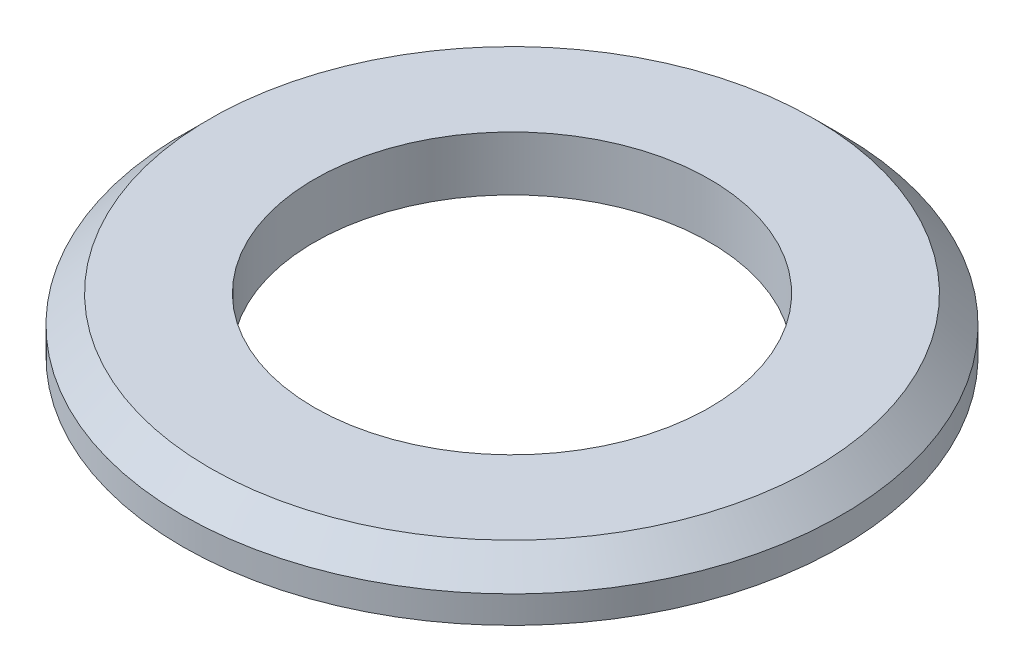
ISO-10303-21;
HEADER;
FILE_DESCRIPTION(('STEP AP214'),'2;1');
FILE_NAME('part.step','',(''),(''),'','','');
FILE_SCHEMA(('AUTOMOTIVE_DESIGN { 1 0 10303 214 1 1 1 1 }'));
ENDSEC;
DATA;
#1=APPLICATION_CONTEXT('core data for automotive mechanical design processes');
#2=APPLICATION_PROTOCOL_DEFINITION('international standard','automotive_design',2000,#1);
#3=PRODUCT_CONTEXT('',#1,'mechanical');
#4=PRODUCT('Part','Part','',(#3));
#5=PRODUCT_RELATED_PRODUCT_CATEGORY('part','',(#4));
#6=PRODUCT_DEFINITION_FORMATION('','',#4);
#7=PRODUCT_DEFINITION_CONTEXT('part definition',#1,'design');
#8=PRODUCT_DEFINITION('design','',#6,#7);
#9=PRODUCT_DEFINITION_SHAPE('','',#8);
#10=(LENGTH_UNIT() NAMED_UNIT(*) SI_UNIT(.MILLI.,.METRE.));
#11=(NAMED_UNIT(*) PLANE_ANGLE_UNIT() SI_UNIT($,.RADIAN.));
#12=(NAMED_UNIT(*) SI_UNIT($,.STERADIAN.) SOLID_ANGLE_UNIT());
#13=UNCERTAINTY_MEASURE_WITH_UNIT(LENGTH_MEASURE(1.E-05),#10,'distance_accuracy_value','');
#14=(GEOMETRIC_REPRESENTATION_CONTEXT(3) GLOBAL_UNCERTAINTY_ASSIGNED_CONTEXT((#13)) GLOBAL_UNIT_ASSIGNED_CONTEXT((#10,
#11,#12)) REPRESENTATION_CONTEXT('',''));
#15=CARTESIAN_POINT('',(0.,0.,0.));
#16=DIRECTION('',(0.,0.,1.));
#17=DIRECTION('',(1.,0.,0.));
#18=AXIS2_PLACEMENT_3D('',#15,#16,#17);
#19=CARTESIAN_POINT('',(0.,12.,0.));
#20=DIRECTION('',(0.,1.,0.));
#21=DIRECTION('',(0.,0.,1.));
#22=AXIS2_PLACEMENT_3D('',#19,#20,#21);
#23=PLANE('',#22);
#24=CARTESIAN_POINT('',(0.,12.,0.));
#25=DIRECTION('',(0.,1.,0.));
#26=DIRECTION('',(0.,0.,1.));
#27=AXIS2_PLACEMENT_3D('',#24,#25,#26);
#28=CIRCLE('',#27,66.5);
#29=CARTESIAN_POINT('',(0.,12.,-66.5));
#30=VERTEX_POINT('',#29);
#31=EDGE_CURVE('E35',#30,#30,#28,.T.);
#32=ORIENTED_EDGE('',*,*,#31,.T.);
#33=EDGE_LOOP('',(#32));
#34=FACE_BOUND('',#33,.T.);
#35=CARTESIAN_POINT('',(0.,12.,0.));
#36=DIRECTION('',(0.,1.,0.));
#37=DIRECTION('',(0.,0.,1.));
#38=AXIS2_PLACEMENT_3D('',#35,#36,#37);
#39=CIRCLE('',#38,43.5);
#40=CARTESIAN_POINT('',(0.,12.,43.5));
#41=VERTEX_POINT('',#40);
#42=EDGE_CURVE('E43',#41,#41,#39,.T.);
#43=ORIENTED_EDGE('',*,*,#42,.F.);
#44=EDGE_LOOP('',(#43));
#45=FACE_BOUND('',#44,.T.);
#46=ADVANCED_FACE('F28',(#34,#45),#23,.T.);
#47=CARTESIAN_POINT('',(0.,0.,0.));
#48=DIRECTION('',(0.,1.,0.));
#49=DIRECTION('',(0.,0.,1.));
#50=AXIS2_PLACEMENT_3D('',#47,#48,#49);
#51=PLANE('',#50);
#52=CARTESIAN_POINT('',(0.,0.,0.));
#53=DIRECTION('',(0.,1.,0.));
#54=DIRECTION('',(0.,0.,1.));
#55=AXIS2_PLACEMENT_3D('',#52,#53,#54);
#56=CIRCLE('',#55,72.5);
#57=CARTESIAN_POINT('',(0.,0.,72.5));
#58=VERTEX_POINT('',#57);
#59=EDGE_CURVE('E39',#58,#58,#56,.T.);
#60=ORIENTED_EDGE('',*,*,#59,.F.);
#61=EDGE_LOOP('',(#60));
#62=FACE_BOUND('',#61,.T.);
#63=CARTESIAN_POINT('',(0.,0.,0.));
#64=DIRECTION('',(0.,1.,0.));
#65=DIRECTION('',(0.,0.,1.));
#66=AXIS2_PLACEMENT_3D('',#63,#64,#65);
#67=CIRCLE('',#66,43.5);
#68=CARTESIAN_POINT('',(0.,0.,43.5));
#69=VERTEX_POINT('',#68);
#70=EDGE_CURVE('E48',#69,#69,#67,.T.);
#71=ORIENTED_EDGE('',*,*,#70,.T.);
#72=EDGE_LOOP('',(#71));
#73=FACE_BOUND('',#72,.T.);
#74=ADVANCED_FACE('F52',(#62,#73),#51,.F.);
#75=CARTESIAN_POINT('',(0.,12.,0.));
#76=DIRECTION('',(0.,-1.,0.));
#77=DIRECTION('',(0.,0.,-1.));
#78=AXIS2_PLACEMENT_3D('',#75,#76,#77);
#79=CYLINDRICAL_SURFACE('',#78,72.5);
#80=CARTESIAN_POINT('',(0.,5.99999999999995,0.));
#81=DIRECTION('',(0.,1.,0.));
#82=DIRECTION('',(0.,0.,1.));
#83=AXIS2_PLACEMENT_3D('',#80,#81,#82);
#84=CIRCLE('',#83,72.5);
#85=CARTESIAN_POINT('',(0.,5.99999999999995,-72.5));
#86=VERTEX_POINT('',#85);
#87=EDGE_CURVE('E10',#86,#86,#84,.F.);
#88=ORIENTED_EDGE('',*,*,#87,.T.);
#89=EDGE_LOOP('',(#88));
#90=FACE_BOUND('',#89,.T.);
#91=ORIENTED_EDGE('',*,*,#59,.T.);
#92=EDGE_LOOP('',(#91));
#93=FACE_BOUND('',#92,.T.);
#94=ADVANCED_FACE('F30',(#90,#93),#79,.T.);
#95=CARTESIAN_POINT('',(0.,12.,0.));
#96=DIRECTION('',(0.,-1.,0.));
#97=DIRECTION('',(0.,0.,-1.));
#98=AXIS2_PLACEMENT_3D('',#95,#96,#97);
#99=CYLINDRICAL_SURFACE('',#98,43.5);
#100=ORIENTED_EDGE('',*,*,#42,.T.);
#101=EDGE_LOOP('',(#100));
#102=FACE_BOUND('',#101,.T.);
#103=ORIENTED_EDGE('',*,*,#70,.F.);
#104=EDGE_LOOP('',(#103));
#105=FACE_BOUND('',#104,.T.);
#106=ADVANCED_FACE('F54',(#102,#105),#99,.F.);
#107=CARTESIAN_POINT('',(0.,12.,0.));
#108=DIRECTION('',(0.,-1.,0.));
#109=DIRECTION('',(0.,0.,-1.));
#110=AXIS2_PLACEMENT_3D('',#107,#108,#109);
#111=CONICAL_SURFACE('',#110,66.5,0.785398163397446);
#112=CARTESIAN_POINT('',(0.,5.99999999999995,-72.5));
#113=CARTESIAN_POINT('',(0.,6.06249999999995,-72.4375));
#114=CARTESIAN_POINT('',(0.,6.12499999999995,-72.375));
#115=CARTESIAN_POINT('',(0.,6.24999999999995,-72.25));
#116=CARTESIAN_POINT('',(0.,6.31249999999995,-72.1875));
#117=CARTESIAN_POINT('',(0.,6.43749999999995,-72.0625));
#118=CARTESIAN_POINT('',(0.,6.49999999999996,-72.));
#119=CARTESIAN_POINT('',(0.,6.62499999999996,-71.875));
#120=CARTESIAN_POINT('',(0.,6.68749999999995,-71.8125));
#121=CARTESIAN_POINT('',(0.,6.81249999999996,-71.6875));
#122=CARTESIAN_POINT('',(0.,6.87499999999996,-71.625));
#123=CARTESIAN_POINT('',(0.,6.99999999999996,-71.5));
#124=CARTESIAN_POINT('',(0.,7.06249999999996,-71.4375));
#125=CARTESIAN_POINT('',(0.,7.18749999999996,-71.3125));
#126=CARTESIAN_POINT('',(0.,7.24999999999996,-71.25));
#127=CARTESIAN_POINT('',(0.,7.37499999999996,-71.125));
#128=CARTESIAN_POINT('',(0.,7.43749999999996,-71.0625));
#129=CARTESIAN_POINT('',(0.,7.56249999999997,-70.9375));
#130=CARTESIAN_POINT('',(0.,7.62499999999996,-70.875));
#131=CARTESIAN_POINT('',(0.,7.74999999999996,-70.75));
#132=CARTESIAN_POINT('',(0.,7.81249999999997,-70.6875));
#133=CARTESIAN_POINT('',(0.,7.93749999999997,-70.5625));
#134=CARTESIAN_POINT('',(0.,7.99999999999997,-70.5));
#135=CARTESIAN_POINT('',(0.,8.12499999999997,-70.375));
#136=CARTESIAN_POINT('',(0.,8.18749999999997,-70.3125));
#137=CARTESIAN_POINT('',(0.,8.31249999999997,-70.1875));
#138=CARTESIAN_POINT('',(0.,8.37499999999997,-70.125));
#139=CARTESIAN_POINT('',(0.,8.49999999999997,-70.));
#140=CARTESIAN_POINT('',(0.,8.56249999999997,-69.9375));
#141=CARTESIAN_POINT('',(0.,8.68749999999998,-69.8125));
#142=CARTESIAN_POINT('',(0.,8.74999999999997,-69.75));
#143=CARTESIAN_POINT('',(0.,8.87499999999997,-69.625));
#144=CARTESIAN_POINT('',(0.,8.93749999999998,-69.5625));
#145=CARTESIAN_POINT('',(0.,9.06249999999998,-69.4375));
#146=CARTESIAN_POINT('',(0.,9.12499999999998,-69.375));
#147=CARTESIAN_POINT('',(0.,9.24999999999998,-69.25));
#148=CARTESIAN_POINT('',(0.,9.31249999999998,-69.1875));
#149=CARTESIAN_POINT('',(0.,9.43749999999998,-69.0625));
#150=CARTESIAN_POINT('',(0.,9.49999999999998,-69.));
#151=CARTESIAN_POINT('',(0.,9.62499999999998,-68.875));
#152=CARTESIAN_POINT('',(0.,9.68749999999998,-68.8125));
#153=CARTESIAN_POINT('',(0.,9.81249999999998,-68.6875));
#154=CARTESIAN_POINT('',(0.,9.87499999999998,-68.625));
#155=CARTESIAN_POINT('',(0.,9.99999999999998,-68.5));
#156=CARTESIAN_POINT('',(0.,10.0625,-68.4375));
#157=CARTESIAN_POINT('',(0.,10.1875,-68.3125));
#158=CARTESIAN_POINT('',(0.,10.25,-68.25));
#159=CARTESIAN_POINT('',(0.,10.375,-68.125));
#160=CARTESIAN_POINT('',(0.,10.4375,-68.0625));
#161=CARTESIAN_POINT('',(0.,10.5625,-67.9375));
#162=CARTESIAN_POINT('',(0.,10.625,-67.875));
#163=CARTESIAN_POINT('',(0.,10.75,-67.75));
#164=CARTESIAN_POINT('',(0.,10.8125,-67.6875));
#165=CARTESIAN_POINT('',(0.,10.9375,-67.5625));
#166=CARTESIAN_POINT('',(0.,11.,-67.5));
#167=CARTESIAN_POINT('',(0.,11.125,-67.375));
#168=CARTESIAN_POINT('',(0.,11.1875,-67.3125));
#169=CARTESIAN_POINT('',(0.,11.3125,-67.1875));
#170=CARTESIAN_POINT('',(0.,11.375,-67.125));
#171=CARTESIAN_POINT('',(0.,11.5,-67.));
#172=CARTESIAN_POINT('',(0.,11.5625,-66.9375));
#173=CARTESIAN_POINT('',(0.,11.6875,-66.8125));
#174=CARTESIAN_POINT('',(0.,11.75,-66.75));
#175=CARTESIAN_POINT('',(0.,11.875,-66.625));
#176=CARTESIAN_POINT('',(0.,11.9375,-66.5625));
#177=CARTESIAN_POINT('',(0.,12.,-66.5));
#178=B_SPLINE_CURVE_WITH_KNOTS('',3,(#112,#113,#114,#115,#116,#117,#118,#119,#120,#121,#122,
#123,#124,#125,#126,#127,#128,#129,#130,#131,#132,#133,#134,#135,#136,#137,#138,#139,#140,#141,
#142,#143,#144,#145,#146,#147,#148,#149,#150,#151,#152,#153,#154,#155,#156,#157,#158,#159,#160,
#161,#162,#163,#164,#165,#166,#167,#168,#169,#170,#171,#172,#173,#174,#175,#176,#177),
.UNSPECIFIED.,.F.,.F.,(4,2,2,2,2,2,2,2,2,2,2,2,2,2,2,2,2,2,2,2,2,2,2,2,2,2,2,2,2,2,2,2,4),(0.,
0.265165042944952,0.530330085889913,0.795495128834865,1.06066017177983,1.32582521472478,
1.59099025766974,1.8561553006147,2.12132034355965,2.38648538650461,2.65165042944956,
2.91681547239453,3.18198051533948,3.44714555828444,3.71231060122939,3.97747564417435,
4.2426406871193,4.50780573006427,4.77297077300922,5.03813581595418,5.30330085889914,
5.56846590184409,5.83363094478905,6.098795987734,6.36396103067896,6.62912607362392,
6.89429111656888,7.15945615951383,7.42462120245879,7.68978624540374,7.9549512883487,
8.22011633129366,8.48528137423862),.UNSPECIFIED.);
#179=EDGE_CURVE('BSEAM56',#86,#30,#178,.T.);
#180=ORIENTED_EDGE('',*,*,#87,.F.);
#181=ORIENTED_EDGE('',*,*,#31,.F.);
#182=ORIENTED_EDGE('',*,*,#179,.T.);
#183=ORIENTED_EDGE('',*,*,#179,.F.);
#184=EDGE_LOOP('',(#180,#182,#181,#183));
#185=FACE_BOUND('',#184,.T.);
#186=ADVANCED_FACE('F56',(#185),#111,.T.);
#187=CLOSED_SHELL('',(#46,#74,#94,#106,#186));
#188=MANIFOLD_SOLID_BREP('B2',#187);
#189=ADVANCED_BREP_SHAPE_REPRESENTATION('',(#18,#188),#14);
#190=SHAPE_DEFINITION_REPRESENTATION(#9,#189);
ENDSEC;
END-ISO-10303-21;
